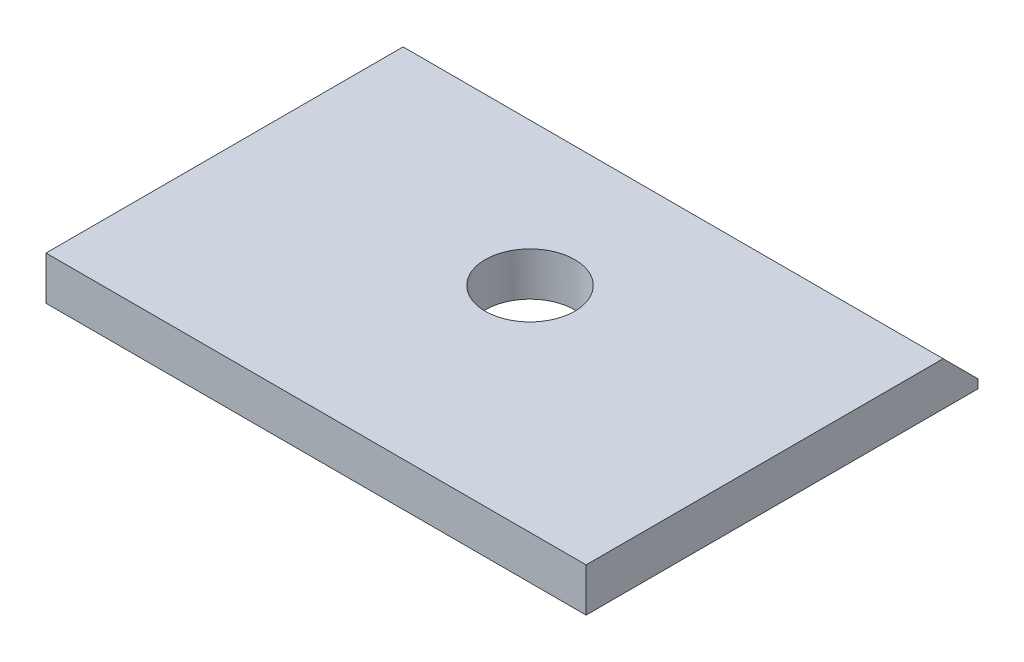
from build123d import *

# Parameters (mm, degrees)
BOSS_EXTRUDE1_DEPTH      = 9.845
BOSS_EXTRUDE1_DEPTH_BACK = 9.845
F_4_CLEARANCE_HOLE1_D    = 3.2639
SKETCH6_W                = 19.69
SKETCH6_H                = 11.1125
CUT_EXTRUDE3_DEPTH       = 17.514542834
SKETCH7_W                = 20.959380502
SKETCH7_H                = 15.104611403
CUT_EXTRUDE4_DEPTH       = 2.2225
CHAMFER1_SIZE            = 1.27


with BuildPart() as part:
    # Sketch1 → Boss-Extrude1 (new, two sides: drawn at the far end of the back side and taken through both)
    with BuildSketch(Plane(origin=(0, 0, 0), x_dir=(0, 0, -1), z_dir=(1, 0, 0)).offset(-BOSS_EXTRUDE1_DEPTH_BACK)):
        Polygon((-12.7, 0), (0, 0), (12.7, 0), (12.7, -3.81), (-12.7, -3.81), align=None)
    extrude(amount=BOSS_EXTRUDE1_DEPTH + BOSS_EXTRUDE1_DEPTH_BACK)

    # 4 Clearance Hole1 (through all)
    with Locations(Plane(origin=(0, 0, 0), x_dir=(-1, 0, 0), z_dir=(0, 1, 0))):
        with Locations((0, -7.9375), (0, 4.9)):
            Hole(F_4_CLEARANCE_HOLE1_D / 2)

    # Sketch6 → Cut-Extrude3 (cut, through all)
    with BuildSketch(Plane(origin=(0, 0, 0), x_dir=(1, 0, 0), z_dir=(0, 1, 0))):
        with Locations((0, 7.14375)):
            Rectangle(SKETCH6_W, SKETCH6_H)
    extrude(amount=-CUT_EXTRUDE3_DEPTH, mode=Mode.SUBTRACT)

    # Sketch7 → Cut-Extrude4 (cut)
    with BuildSketch(Plane(origin=(0, 0, 0), x_dir=(1, 0, 0), z_dir=(0, 1, 0))):
        with Locations((-0.069287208, -5.551005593)):
            Rectangle(SKETCH7_W, SKETCH7_H)
    extrude(amount=-CUT_EXTRUDE4_DEPTH, mode=Mode.SUBTRACT)

    # Chamfer1
    chamfer1_edges = [part.edges().sort_by_distance(p)[0] for p in [
        (0, -2.2225, -1.5875),
    ]]
    chamfer(chamfer1_edges, length=CHAMFER1_SIZE)


solid = part.part
